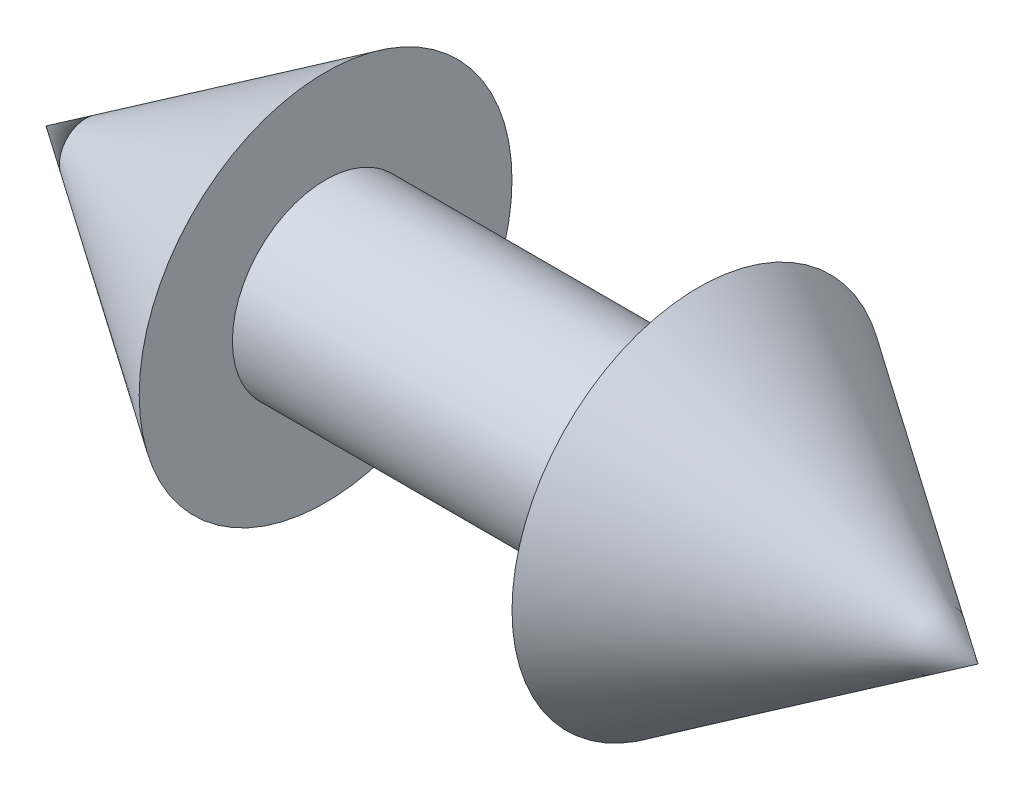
ISO-10303-21;
HEADER;
FILE_DESCRIPTION(('STEP AP214'),'2;1');
FILE_NAME('part.step','',(''),(''),'','','');
FILE_SCHEMA(('AUTOMOTIVE_DESIGN { 1 0 10303 214 1 1 1 1 }'));
ENDSEC;
DATA;
#1=APPLICATION_CONTEXT('core data for automotive mechanical design processes');
#2=APPLICATION_PROTOCOL_DEFINITION('international standard','automotive_design',2000,#1);
#3=PRODUCT_CONTEXT('',#1,'mechanical');
#4=PRODUCT('Part','Part','',(#3));
#5=PRODUCT_RELATED_PRODUCT_CATEGORY('part','',(#4));
#6=PRODUCT_DEFINITION_FORMATION('','',#4);
#7=PRODUCT_DEFINITION_CONTEXT('part definition',#1,'design');
#8=PRODUCT_DEFINITION('design','',#6,#7);
#9=PRODUCT_DEFINITION_SHAPE('','',#8);
#10=(LENGTH_UNIT() NAMED_UNIT(*) SI_UNIT(.MILLI.,.METRE.));
#11=(NAMED_UNIT(*) PLANE_ANGLE_UNIT() SI_UNIT($,.RADIAN.));
#12=(NAMED_UNIT(*) SI_UNIT($,.STERADIAN.) SOLID_ANGLE_UNIT());
#13=UNCERTAINTY_MEASURE_WITH_UNIT(LENGTH_MEASURE(1.E-05),#10,'distance_accuracy_value','');
#14=(GEOMETRIC_REPRESENTATION_CONTEXT(3) GLOBAL_UNCERTAINTY_ASSIGNED_CONTEXT((#13)) GLOBAL_UNIT_ASSIGNED_CONTEXT((#10,
#11,#12)) REPRESENTATION_CONTEXT('',''));
#15=CARTESIAN_POINT('',(0.,0.,0.));
#16=DIRECTION('',(0.,0.,1.));
#17=DIRECTION('',(1.,0.,0.));
#18=AXIS2_PLACEMENT_3D('',#15,#16,#17);
#19=CARTESIAN_POINT('',(0.499999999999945,0.,0.));
#20=DIRECTION('',(-1.,0.,0.));
#21=DIRECTION('',(0.,0.,1.));
#22=AXIS2_PLACEMENT_3D('',#19,#20,#21);
#23=CONICAL_SURFACE('',#22,0.5,0.588002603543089);
#24=CARTESIAN_POINT('',(1.25000000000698,0.,0.));
#25=VERTEX_POINT('',#24);
#26=VERTEX_LOOP('',#25);
#27=FACE_BOUND('',#26,.T.);
#28=CARTESIAN_POINT('',(0.499999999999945,0.,0.));
#29=DIRECTION('',(-1.,0.,0.));
#30=DIRECTION('',(0.,0.,1.));
#31=AXIS2_PLACEMENT_3D('',#28,#29,#30);
#32=CIRCLE('',#31,0.5);
#33=CARTESIAN_POINT('',(0.499999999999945,0.,0.5));
#34=VERTEX_POINT('',#33);
#35=EDGE_CURVE('E57',#34,#34,#32,.T.);
#36=ORIENTED_EDGE('',*,*,#35,.F.);
#37=EDGE_LOOP('',(#36));
#38=FACE_BOUND('',#37,.T.);
#39=ADVANCED_FACE('F39',(#27,#38),#23,.T.);
#40=CARTESIAN_POINT('',(-0.500000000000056,0.,0.));
#41=DIRECTION('',(1.,0.,0.));
#42=DIRECTION('',(0.,0.,-1.));
#43=AXIS2_PLACEMENT_3D('',#40,#41,#42);
#44=CONICAL_SURFACE('',#43,0.5,0.588002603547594);
#45=CARTESIAN_POINT('',(-1.25,0.,0.));
#46=VERTEX_POINT('',#45);
#47=VERTEX_LOOP('',#46);
#48=FACE_BOUND('',#47,.T.);
#49=CARTESIAN_POINT('',(-0.500000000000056,0.,0.));
#50=DIRECTION('',(-1.,0.,0.));
#51=DIRECTION('',(0.,0.,1.));
#52=AXIS2_PLACEMENT_3D('',#49,#50,#51);
#53=CIRCLE('',#52,0.5);
#54=CARTESIAN_POINT('',(-0.500000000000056,0.,0.5));
#55=VERTEX_POINT('',#54);
#56=EDGE_CURVE('E11',#55,#55,#53,.T.);
#57=ORIENTED_EDGE('',*,*,#56,.T.);
#58=EDGE_LOOP('',(#57));
#59=FACE_BOUND('',#58,.T.);
#60=ADVANCED_FACE('F54',(#48,#59),#44,.T.);
#61=CARTESIAN_POINT('',(-0.500000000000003,0.25,0.));
#62=DIRECTION('',(-1.,0.,0.));
#63=DIRECTION('',(0.,0.,1.));
#64=AXIS2_PLACEMENT_3D('',#61,#62,#63);
#65=PLANE('',#64);
#66=ORIENTED_EDGE('',*,*,#56,.F.);
#67=EDGE_LOOP('',(#66));
#68=FACE_BOUND('',#67,.T.);
#69=CARTESIAN_POINT('',(-0.500000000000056,0.,0.));
#70=DIRECTION('',(-1.,0.,0.));
#71=DIRECTION('',(0.,0.,1.));
#72=AXIS2_PLACEMENT_3D('',#69,#70,#71);
#73=CIRCLE('',#72,0.25);
#74=CARTESIAN_POINT('',(-0.500000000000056,0.,0.25));
#75=VERTEX_POINT('',#74);
#76=EDGE_CURVE('E46',#75,#75,#73,.T.);
#77=ORIENTED_EDGE('',*,*,#76,.T.);
#78=EDGE_LOOP('',(#77));
#79=FACE_BOUND('',#78,.T.);
#80=ADVANCED_FACE('F66',(#68,#79),#65,.F.);
#81=CARTESIAN_POINT('',(-1000.,0.,0.));
#82=DIRECTION('',(-1.,0.,0.));
#83=DIRECTION('',(0.,0.,1.));
#84=AXIS2_PLACEMENT_3D('',#81,#82,#83);
#85=CYLINDRICAL_SURFACE('',#84,0.25);
#86=CARTESIAN_POINT('',(0.499999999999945,0.,0.));
#87=DIRECTION('',(-1.,0.,0.));
#88=DIRECTION('',(0.,0.,1.));
#89=AXIS2_PLACEMENT_3D('',#86,#87,#88);
#90=CIRCLE('',#89,0.25);
#91=CARTESIAN_POINT('',(0.499999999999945,0.,0.25));
#92=VERTEX_POINT('',#91);
#93=EDGE_CURVE('E59',#92,#92,#90,.T.);
#94=ORIENTED_EDGE('',*,*,#93,.T.);
#95=EDGE_LOOP('',(#94));
#96=FACE_BOUND('',#95,.T.);
#97=ORIENTED_EDGE('',*,*,#76,.F.);
#98=EDGE_LOOP('',(#97));
#99=FACE_BOUND('',#98,.T.);
#100=ADVANCED_FACE('F68',(#96,#99),#85,.T.);
#101=CARTESIAN_POINT('',(0.5,0.25,0.));
#102=DIRECTION('',(-1.,0.,0.));
#103=DIRECTION('',(0.,0.,1.));
#104=AXIS2_PLACEMENT_3D('',#101,#102,#103);
#105=PLANE('',#104);
#106=ORIENTED_EDGE('',*,*,#35,.T.);
#107=EDGE_LOOP('',(#106));
#108=FACE_BOUND('',#107,.T.);
#109=ORIENTED_EDGE('',*,*,#93,.F.);
#110=EDGE_LOOP('',(#109));
#111=FACE_BOUND('',#110,.T.);
#112=ADVANCED_FACE('F70',(#108,#111),#105,.T.);
#113=CLOSED_SHELL('',(#39,#60,#80,#100,#112));
#114=MANIFOLD_SOLID_BREP('B2',#113);
#115=ADVANCED_BREP_SHAPE_REPRESENTATION('',(#18,#114),#14);
#116=SHAPE_DEFINITION_REPRESENTATION(#9,#115);
ENDSEC;
END-ISO-10303-21;
